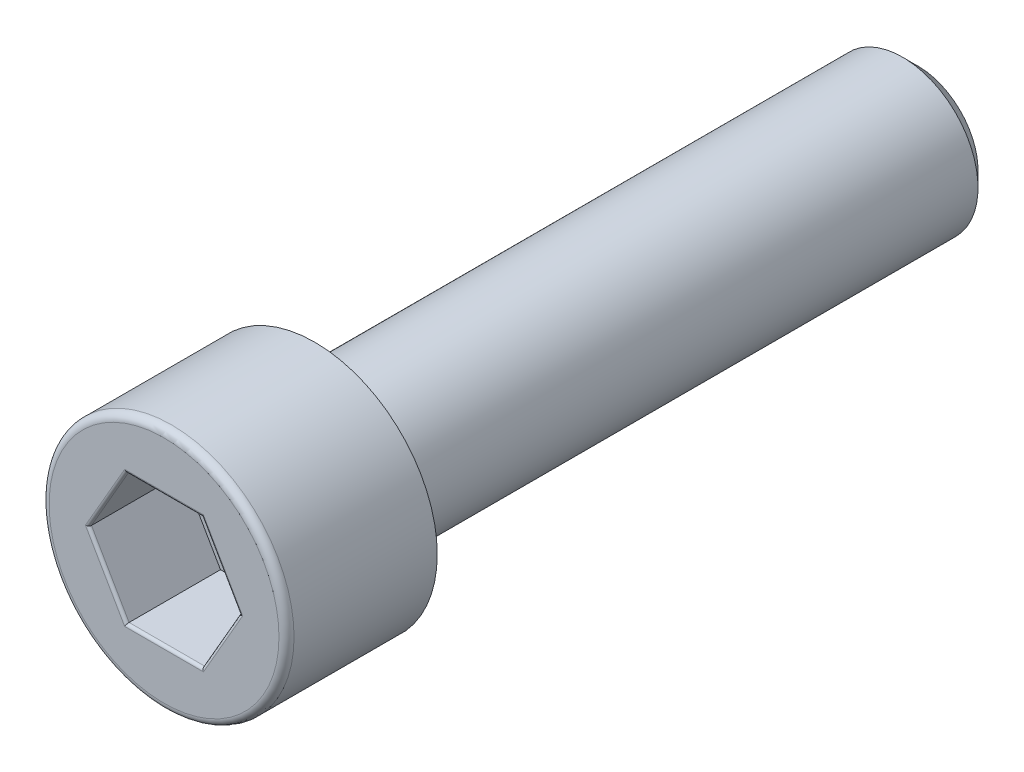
ISO-10303-21;
HEADER;
FILE_DESCRIPTION(('STEP AP214'),'2;1');
FILE_NAME('part.step','',(''),(''),'','','');
FILE_SCHEMA(('AUTOMOTIVE_DESIGN { 1 0 10303 214 1 1 1 1 }'));
ENDSEC;
DATA;
#1=APPLICATION_CONTEXT('core data for automotive mechanical design processes');
#2=APPLICATION_PROTOCOL_DEFINITION('international standard','automotive_design',2000,#1);
#3=PRODUCT_CONTEXT('',#1,'mechanical');
#4=PRODUCT('Part','Part','',(#3));
#5=PRODUCT_RELATED_PRODUCT_CATEGORY('part','',(#4));
#6=PRODUCT_DEFINITION_FORMATION('','',#4);
#7=PRODUCT_DEFINITION_CONTEXT('part definition',#1,'design');
#8=PRODUCT_DEFINITION('design','',#6,#7);
#9=PRODUCT_DEFINITION_SHAPE('','',#8);
#10=(LENGTH_UNIT() NAMED_UNIT(*) SI_UNIT(.MILLI.,.METRE.));
#11=(NAMED_UNIT(*) PLANE_ANGLE_UNIT() SI_UNIT($,.RADIAN.));
#12=(NAMED_UNIT(*) SI_UNIT($,.STERADIAN.) SOLID_ANGLE_UNIT());
#13=UNCERTAINTY_MEASURE_WITH_UNIT(LENGTH_MEASURE(1.E-05),#10,'distance_accuracy_value','');
#14=(GEOMETRIC_REPRESENTATION_CONTEXT(3) GLOBAL_UNCERTAINTY_ASSIGNED_CONTEXT((#13)) GLOBAL_UNIT_ASSIGNED_CONTEXT((#10,
#11,#12)) REPRESENTATION_CONTEXT('',''));
#15=CARTESIAN_POINT('',(0.,0.,0.));
#16=DIRECTION('',(0.,0.,1.));
#17=DIRECTION('',(1.,0.,0.));
#18=AXIS2_PLACEMENT_3D('',#15,#16,#17);
#19=CARTESIAN_POINT('',(0.,0.,0.));
#20=DIRECTION('',(0.,0.,1.));
#21=DIRECTION('',(1.,0.,0.));
#22=AXIS2_PLACEMENT_3D('',#19,#20,#21);
#23=PLANE('',#22);
#24=CARTESIAN_POINT('',(0.,0.,0.));
#25=DIRECTION('',(0.,0.,1.));
#26=DIRECTION('',(1.,0.,0.));
#27=AXIS2_PLACEMENT_3D('',#24,#25,#26);
#28=CIRCLE('',#27,6.5);
#29=CARTESIAN_POINT('',(6.5,0.,0.));
#30=VERTEX_POINT('',#29);
#31=EDGE_CURVE('E116',#30,#30,#28,.T.);
#32=ORIENTED_EDGE('',*,*,#31,.F.);
#33=EDGE_LOOP('',(#32));
#34=FACE_BOUND('',#33,.T.);
#35=CARTESIAN_POINT('',(0.,0.,0.));
#36=DIRECTION('',(0.,0.,-1.));
#37=DIRECTION('',(-1.,0.,0.));
#38=AXIS2_PLACEMENT_3D('',#35,#36,#37);
#39=CIRCLE('',#38,4.);
#40=CARTESIAN_POINT('',(-4.,0.,0.));
#41=VERTEX_POINT('',#40);
#42=EDGE_CURVE('E184',#41,#41,#39,.T.);
#43=ORIENTED_EDGE('',*,*,#42,.F.);
#44=EDGE_LOOP('',(#43));
#45=FACE_BOUND('',#44,.T.);
#46=ADVANCED_FACE('F34',(#34,#45),#23,.F.);
#47=CARTESIAN_POINT('',(0.,0.,8.));
#48=DIRECTION('',(0.,0.,1.));
#49=DIRECTION('',(1.,0.,0.));
#50=AXIS2_PLACEMENT_3D('',#47,#48,#49);
#51=PLANE('',#50);
#52=DIRECTION('',(0.499481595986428,-0.866324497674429,0.));
#53=VECTOR('',#52,1.);
#54=CARTESIAN_POINT('',(3.13202121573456,1.80577481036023,8.));
#55=LINE('',#54,#53);
#56=CARTESIAN_POINT('',(2.09080748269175,3.61170514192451,8.));
#57=VERTEX_POINT('',#56);
#58=CARTESIAN_POINT('',(4.173145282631,0.,8.));
#59=VERTEX_POINT('',#58);
#60=EDGE_CURVE('E162',#57,#59,#55,.T.);
#61=ORIENTED_EDGE('',*,*,#60,.T.);
#62=DIRECTION('',(-0.499481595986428,-0.866324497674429,0.));
#63=VECTOR('',#62,1.);
#64=CARTESIAN_POINT('',(3.13202121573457,-1.80577481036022,8.));
#65=LINE('',#64,#63);
#66=CARTESIAN_POINT('',(2.09080748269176,-3.61170514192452,8.));
#67=VERTEX_POINT('',#66);
#68=EDGE_CURVE('E172',#59,#67,#65,.T.);
#69=ORIENTED_EDGE('',*,*,#68,.T.);
#70=DIRECTION('',(-1.,0.,0.));
#71=VECTOR('',#70,1.);
#72=CARTESIAN_POINT('',(0.,-3.61170514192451,8.));
#73=LINE('',#72,#71);
#74=CARTESIAN_POINT('',(-2.09080748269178,-3.61170514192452,8.));
#75=VERTEX_POINT('',#74);
#76=EDGE_CURVE('E170',#67,#75,#73,.T.);
#77=ORIENTED_EDGE('',*,*,#76,.T.);
#78=DIRECTION('',(-0.499481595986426,0.86632449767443,0.));
#79=VECTOR('',#78,1.);
#80=CARTESIAN_POINT('',(-3.13202121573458,-1.80577481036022,8.));
#81=LINE('',#80,#79);
#82=CARTESIAN_POINT('',(-4.173145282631,0.,8.));
#83=VERTEX_POINT('',#82);
#84=EDGE_CURVE('E168',#75,#83,#81,.T.);
#85=ORIENTED_EDGE('',*,*,#84,.T.);
#86=DIRECTION('',(0.499481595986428,0.866324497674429,0.));
#87=VECTOR('',#86,1.);
#88=CARTESIAN_POINT('',(-3.13202121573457,1.80577481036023,8.));
#89=LINE('',#88,#87);
#90=CARTESIAN_POINT('',(-2.09080748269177,3.61170514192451,8.));
#91=VERTEX_POINT('',#90);
#92=EDGE_CURVE('E166',#83,#91,#89,.T.);
#93=ORIENTED_EDGE('',*,*,#92,.T.);
#94=DIRECTION('',(1.,0.,0.));
#95=VECTOR('',#94,1.);
#96=CARTESIAN_POINT('',(0.,3.61170514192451,8.));
#97=LINE('',#96,#95);
#98=EDGE_CURVE('E164',#91,#57,#97,.T.);
#99=ORIENTED_EDGE('',*,*,#98,.T.);
#100=EDGE_LOOP('',(#61,#69,#77,#85,#93,#99));
#101=FACE_BOUND('',#100,.T.);
#102=CARTESIAN_POINT('',(0.,0.,8.));
#103=DIRECTION('',(0.,0.,1.));
#104=DIRECTION('',(1.,0.,0.));
#105=AXIS2_PLACEMENT_3D('',#102,#103,#104);
#106=CIRCLE('',#105,6.1);
#107=CARTESIAN_POINT('',(6.1,0.,8.));
#108=VERTEX_POINT('',#107);
#109=EDGE_CURVE('E156',#108,#108,#106,.T.);
#110=ORIENTED_EDGE('',*,*,#109,.T.);
#111=EDGE_LOOP('',(#110));
#112=FACE_BOUND('',#111,.T.);
#113=ADVANCED_FACE('F237',(#101,#112),#51,.T.);
#114=CARTESIAN_POINT('',(0.,0.,8.));
#115=DIRECTION('',(0.,0.,-1.));
#116=DIRECTION('',(-1.,0.,0.));
#117=AXIS2_PLACEMENT_3D('',#114,#115,#116);
#118=CYLINDRICAL_SURFACE('',#117,6.5);
#119=CARTESIAN_POINT('',(0.,0.,7.6));
#120=DIRECTION('',(0.,0.,1.));
#121=DIRECTION('',(1.,0.,0.));
#122=AXIS2_PLACEMENT_3D('',#119,#120,#121);
#123=CIRCLE('',#122,6.5);
#124=CARTESIAN_POINT('',(6.5,0.,7.6));
#125=VERTEX_POINT('',#124);
#126=EDGE_CURVE('E159',#125,#125,#123,.F.);
#127=ORIENTED_EDGE('',*,*,#126,.T.);
#128=EDGE_LOOP('',(#127));
#129=FACE_BOUND('',#128,.T.);
#130=ORIENTED_EDGE('',*,*,#31,.T.);
#131=EDGE_LOOP('',(#130));
#132=FACE_BOUND('',#131,.T.);
#133=ADVANCED_FACE('F36',(#129,#132),#118,.T.);
#134=CARTESIAN_POINT('',(-2.00414508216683,-3.46170514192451,3.));
#135=DIRECTION('',(0.86632449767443,0.499481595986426,0.));
#136=DIRECTION('',(-0.499481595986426,0.86632449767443,0.));
#137=AXIS2_PLACEMENT_3D('',#134,#135,#136);
#138=PLANE('',#137);
#139=DIRECTION('',(0.,0.,1.));
#140=VECTOR('',#139,1.);
#141=CARTESIAN_POINT('',(-4.,0.,3.));
#142=LINE('',#141,#140);
#143=CARTESIAN_POINT('',(-4.,0.,3.));
#144=VERTEX_POINT('',#143);
#145=CARTESIAN_POINT('',(-4.,0.,7.85));
#146=VERTEX_POINT('',#145);
#147=EDGE_CURVE('E106',#144,#146,#142,.T.);
#148=ORIENTED_EDGE('',*,*,#147,.T.);
#149=DIRECTION('',(-0.499481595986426,0.86632449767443,0.));
#150=VECTOR('',#149,1.);
#151=CARTESIAN_POINT('',(-2.00414508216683,-3.46170514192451,7.85));
#152=LINE('',#151,#150);
#153=CARTESIAN_POINT('',(-2.00414508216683,-3.46170514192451,7.85));
#154=VERTEX_POINT('',#153);
#155=EDGE_CURVE('E180',#146,#154,#152,.F.);
#156=ORIENTED_EDGE('',*,*,#155,.T.);
#157=DIRECTION('',(0.,0.,1.));
#158=VECTOR('',#157,1.);
#159=CARTESIAN_POINT('',(-2.00414508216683,-3.46170514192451,3.));
#160=LINE('',#159,#158);
#161=CARTESIAN_POINT('',(-2.00414508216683,-3.46170514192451,3.));
#162=VERTEX_POINT('',#161);
#163=EDGE_CURVE('E123',#162,#154,#160,.T.);
#164=ORIENTED_EDGE('',*,*,#163,.F.);
#165=DIRECTION('',(-0.499481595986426,0.86632449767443,0.));
#166=VECTOR('',#165,1.);
#167=CARTESIAN_POINT('',(-2.00414508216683,-3.46170514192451,3.));
#168=LINE('',#167,#166);
#169=EDGE_CURVE('E120',#162,#144,#168,.T.);
#170=ORIENTED_EDGE('',*,*,#169,.T.);
#171=EDGE_LOOP('',(#148,#156,#164,#170));
#172=FACE_BOUND('',#171,.T.);
#173=ADVANCED_FACE('F121',(#172),#138,.T.);
#174=CARTESIAN_POINT('',(-4.,0.,3.));
#175=DIRECTION('',(0.866324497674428,-0.499481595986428,0.));
#176=DIRECTION('',(0.499481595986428,0.866324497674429,0.));
#177=AXIS2_PLACEMENT_3D('',#174,#175,#176);
#178=PLANE('',#177);
#179=DIRECTION('',(0.,0.,1.));
#180=VECTOR('',#179,1.);
#181=CARTESIAN_POINT('',(-2.0041450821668,3.46170514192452,3.));
#182=LINE('',#181,#180);
#183=CARTESIAN_POINT('',(-2.0041450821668,3.46170514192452,3.));
#184=VERTEX_POINT('',#183);
#185=CARTESIAN_POINT('',(-2.0041450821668,3.46170514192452,7.85));
#186=VERTEX_POINT('',#185);
#187=EDGE_CURVE('E117',#184,#186,#182,.T.);
#188=ORIENTED_EDGE('',*,*,#187,.T.);
#189=DIRECTION('',(0.499481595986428,0.866324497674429,0.));
#190=VECTOR('',#189,1.);
#191=CARTESIAN_POINT('',(-4.,0.,7.85));
#192=LINE('',#191,#190);
#193=EDGE_CURVE('E113',#186,#146,#192,.F.);
#194=ORIENTED_EDGE('',*,*,#193,.T.);
#195=ORIENTED_EDGE('',*,*,#147,.F.);
#196=DIRECTION('',(0.499481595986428,0.866324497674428,0.));
#197=VECTOR('',#196,1.);
#198=CARTESIAN_POINT('',(-4.,0.,3.));
#199=LINE('',#198,#197);
#200=EDGE_CURVE('E110',#144,#184,#199,.T.);
#201=ORIENTED_EDGE('',*,*,#200,.T.);
#202=EDGE_LOOP('',(#188,#194,#195,#201));
#203=FACE_BOUND('',#202,.T.);
#204=ADVANCED_FACE('F108',(#203),#178,.T.);
#205=CARTESIAN_POINT('',(-2.0041450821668,3.46170514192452,3.));
#206=DIRECTION('',(0.,-1.,0.));
#207=DIRECTION('',(0.,0.,-1.));
#208=AXIS2_PLACEMENT_3D('',#205,#206,#207);
#209=PLANE('',#208);
#210=DIRECTION('',(0.,0.,1.));
#211=VECTOR('',#210,1.);
#212=CARTESIAN_POINT('',(2.00414508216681,3.46170514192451,3.));
#213=LINE('',#212,#211);
#214=CARTESIAN_POINT('',(2.00414508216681,3.46170514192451,3.));
#215=VERTEX_POINT('',#214);
#216=CARTESIAN_POINT('',(2.00414508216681,3.46170514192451,7.85));
#217=VERTEX_POINT('',#216);
#218=EDGE_CURVE('E151',#215,#217,#213,.T.);
#219=ORIENTED_EDGE('',*,*,#218,.T.);
#220=DIRECTION('',(1.,0.,0.));
#221=VECTOR('',#220,1.);
#222=CARTESIAN_POINT('',(-2.0041450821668,3.46170514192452,7.85));
#223=LINE('',#222,#221);
#224=EDGE_CURVE('E56',#217,#186,#223,.F.);
#225=ORIENTED_EDGE('',*,*,#224,.T.);
#226=ORIENTED_EDGE('',*,*,#187,.F.);
#227=DIRECTION('',(1.,0.,0.));
#228=VECTOR('',#227,1.);
#229=CARTESIAN_POINT('',(-2.0041450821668,3.46170514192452,3.));
#230=LINE('',#229,#228);
#231=EDGE_CURVE('E132',#184,#215,#230,.T.);
#232=ORIENTED_EDGE('',*,*,#231,.T.);
#233=EDGE_LOOP('',(#219,#225,#226,#232));
#234=FACE_BOUND('',#233,.T.);
#235=ADVANCED_FACE('F227',(#234),#209,.T.);
#236=CARTESIAN_POINT('',(2.00414508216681,3.46170514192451,3.));
#237=DIRECTION('',(-0.866324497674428,-0.499481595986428,0.));
#238=DIRECTION('',(0.499481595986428,-0.866324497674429,0.));
#239=AXIS2_PLACEMENT_3D('',#236,#237,#238);
#240=PLANE('',#239);
#241=DIRECTION('',(0.,0.,1.));
#242=VECTOR('',#241,1.);
#243=CARTESIAN_POINT('',(4.,0.,3.));
#244=LINE('',#243,#242);
#245=CARTESIAN_POINT('',(4.,0.,3.));
#246=VERTEX_POINT('',#245);
#247=CARTESIAN_POINT('',(4.,0.,7.85));
#248=VERTEX_POINT('',#247);
#249=EDGE_CURVE('E149',#246,#248,#244,.T.);
#250=ORIENTED_EDGE('',*,*,#249,.T.);
#251=DIRECTION('',(0.499481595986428,-0.866324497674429,0.));
#252=VECTOR('',#251,1.);
#253=CARTESIAN_POINT('',(2.00414508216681,3.46170514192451,7.85));
#254=LINE('',#253,#252);
#255=EDGE_CURVE('E49',#248,#217,#254,.F.);
#256=ORIENTED_EDGE('',*,*,#255,.T.);
#257=ORIENTED_EDGE('',*,*,#218,.F.);
#258=DIRECTION('',(0.499481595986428,-0.866324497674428,0.));
#259=VECTOR('',#258,1.);
#260=CARTESIAN_POINT('',(2.00414508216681,3.46170514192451,3.));
#261=LINE('',#260,#259);
#262=EDGE_CURVE('E134',#215,#246,#261,.T.);
#263=ORIENTED_EDGE('',*,*,#262,.T.);
#264=EDGE_LOOP('',(#250,#256,#257,#263));
#265=FACE_BOUND('',#264,.T.);
#266=ADVANCED_FACE('F226',(#265),#240,.T.);
#267=CARTESIAN_POINT('',(4.,0.,3.));
#268=DIRECTION('',(-0.866324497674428,0.499481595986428,0.));
#269=DIRECTION('',(-0.499481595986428,-0.866324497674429,0.));
#270=AXIS2_PLACEMENT_3D('',#267,#268,#269);
#271=PLANE('',#270);
#272=DIRECTION('',(0.,0.,1.));
#273=VECTOR('',#272,1.);
#274=CARTESIAN_POINT('',(2.0041450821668,-3.46170514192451,3.));
#275=LINE('',#274,#273);
#276=CARTESIAN_POINT('',(2.0041450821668,-3.46170514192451,3.));
#277=VERTEX_POINT('',#276);
#278=CARTESIAN_POINT('',(2.0041450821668,-3.46170514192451,7.85));
#279=VERTEX_POINT('',#278);
#280=EDGE_CURVE('E146',#277,#279,#275,.T.);
#281=ORIENTED_EDGE('',*,*,#280,.T.);
#282=DIRECTION('',(-0.499481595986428,-0.866324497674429,0.));
#283=VECTOR('',#282,1.);
#284=CARTESIAN_POINT('',(4.,0.,7.85));
#285=LINE('',#284,#283);
#286=EDGE_CURVE('E175',#279,#248,#285,.F.);
#287=ORIENTED_EDGE('',*,*,#286,.T.);
#288=ORIENTED_EDGE('',*,*,#249,.F.);
#289=DIRECTION('',(-0.499481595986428,-0.866324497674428,0.));
#290=VECTOR('',#289,1.);
#291=CARTESIAN_POINT('',(4.,0.,3.));
#292=LINE('',#291,#290);
#293=EDGE_CURVE('E140',#246,#277,#292,.T.);
#294=ORIENTED_EDGE('',*,*,#293,.T.);
#295=EDGE_LOOP('',(#281,#287,#288,#294));
#296=FACE_BOUND('',#295,.T.);
#297=ADVANCED_FACE('F224',(#296),#271,.T.);
#298=CARTESIAN_POINT('',(2.0041450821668,-3.46170514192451,3.));
#299=DIRECTION('',(0.,1.,0.));
#300=DIRECTION('',(-1.,0.,0.));
#301=AXIS2_PLACEMENT_3D('',#298,#299,#300);
#302=PLANE('',#301);
#303=ORIENTED_EDGE('',*,*,#163,.T.);
#304=DIRECTION('',(-1.,0.,0.));
#305=VECTOR('',#304,1.);
#306=CARTESIAN_POINT('',(2.0041450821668,-3.46170514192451,7.85));
#307=LINE('',#306,#305);
#308=EDGE_CURVE('E178',#154,#279,#307,.F.);
#309=ORIENTED_EDGE('',*,*,#308,.T.);
#310=ORIENTED_EDGE('',*,*,#280,.F.);
#311=DIRECTION('',(-1.,0.,0.));
#312=VECTOR('',#311,1.);
#313=CARTESIAN_POINT('',(2.0041450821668,-3.46170514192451,3.));
#314=LINE('',#313,#312);
#315=EDGE_CURVE('E143',#277,#162,#314,.T.);
#316=ORIENTED_EDGE('',*,*,#315,.T.);
#317=EDGE_LOOP('',(#303,#309,#310,#316));
#318=FACE_BOUND('',#317,.T.);
#319=ADVANCED_FACE('F221',(#318),#302,.T.);
#320=CARTESIAN_POINT('',(-5.99585491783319,3.46170514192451,3.));
#321=DIRECTION('',(0.,0.,-1.));
#322=DIRECTION('',(-1.,0.,0.));
#323=AXIS2_PLACEMENT_3D('',#320,#321,#322);
#324=PLANE('',#323);
#325=ORIENTED_EDGE('',*,*,#169,.F.);
#326=ORIENTED_EDGE('',*,*,#315,.F.);
#327=ORIENTED_EDGE('',*,*,#293,.F.);
#328=ORIENTED_EDGE('',*,*,#262,.F.);
#329=ORIENTED_EDGE('',*,*,#231,.F.);
#330=ORIENTED_EDGE('',*,*,#200,.F.);
#331=EDGE_LOOP('',(#325,#326,#327,#328,#329,#330));
#332=FACE_BOUND('',#331,.T.);
#333=ADVANCED_FACE('F129',(#332),#324,.F.);
#334=CARTESIAN_POINT('',(0.,0.,7.6));
#335=DIRECTION('',(0.,0.,1.));
#336=DIRECTION('',(1.,0.,0.));
#337=AXIS2_PLACEMENT_3D('',#334,#335,#336);
#338=TOROIDAL_SURFACE('',#337,6.1,0.4);
#339=ORIENTED_EDGE('',*,*,#126,.F.);
#340=EDGE_LOOP('',(#339));
#341=FACE_BOUND('',#340,.T.);
#342=ORIENTED_EDGE('',*,*,#109,.F.);
#343=EDGE_LOOP('',(#342));
#344=FACE_BOUND('',#343,.T.);
#345=ADVANCED_FACE('F255',(#341,#344),#338,.T.);
#346=CARTESIAN_POINT('',(-3.13202121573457,1.80577481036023,7.85));
#347=DIRECTION('',(0.499481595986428,0.866324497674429,0.));
#348=DIRECTION('',(-0.866324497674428,0.499481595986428,0.));
#349=AXIS2_PLACEMENT_3D('',#346,#347,#348);
#350=CYLINDRICAL_SURFACE('',#349,0.15);
#351=CARTESIAN_POINT('',(-4.173145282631,0.,7.85));
#352=DIRECTION('',(0.,1.,0.));
#353=DIRECTION('',(-1.,0.,0.));
#354=AXIS2_PLACEMENT_3D('',#351,#352,#353);
#355=ELLIPSE('',#354,0.173145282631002,0.15);
#356=EDGE_CURVE('E203',#146,#83,#355,.F.);
#357=ORIENTED_EDGE('',*,*,#356,.F.);
#358=ORIENTED_EDGE('',*,*,#193,.F.);
#359=CARTESIAN_POINT('',(-2.09080748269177,3.61170514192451,7.85));
#360=DIRECTION('',(0.865875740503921,0.500259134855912,0.));
#361=DIRECTION('',(-0.500259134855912,0.865875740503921,0.));
#362=AXIS2_PLACEMENT_3D('',#359,#360,#361);
#363=ELLIPSE('',#362,0.173235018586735,0.15);
#364=EDGE_CURVE('E127',#91,#186,#363,.T.);
#365=ORIENTED_EDGE('',*,*,#364,.F.);
#366=ORIENTED_EDGE('',*,*,#92,.F.);
#367=EDGE_LOOP('',(#357,#358,#365,#366));
#368=FACE_BOUND('',#367,.T.);
#369=ADVANCED_FACE('F213',(#368),#350,.T.);
#370=CARTESIAN_POINT('',(0.,3.61170514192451,7.85));
#371=DIRECTION('',(1.,0.,0.));
#372=DIRECTION('',(0.,0.,-1.));
#373=AXIS2_PLACEMENT_3D('',#370,#371,#372);
#374=CYLINDRICAL_SURFACE('',#373,0.15);
#375=ORIENTED_EDGE('',*,*,#364,.T.);
#376=ORIENTED_EDGE('',*,*,#224,.F.);
#377=CARTESIAN_POINT('',(2.09080748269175,3.61170514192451,7.85));
#378=DIRECTION('',(0.865875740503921,-0.500259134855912,0.));
#379=DIRECTION('',(0.500259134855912,0.865875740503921,0.));
#380=AXIS2_PLACEMENT_3D('',#377,#378,#379);
#381=ELLIPSE('',#380,0.173235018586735,0.15);
#382=EDGE_CURVE('E200',#57,#217,#381,.T.);
#383=ORIENTED_EDGE('',*,*,#382,.F.);
#384=ORIENTED_EDGE('',*,*,#98,.F.);
#385=EDGE_LOOP('',(#375,#376,#383,#384));
#386=FACE_BOUND('',#385,.T.);
#387=ADVANCED_FACE('F209',(#386),#374,.T.);
#388=CARTESIAN_POINT('',(-3.13202121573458,-1.80577481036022,7.85));
#389=DIRECTION('',(-0.499481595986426,0.86632449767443,0.));
#390=DIRECTION('',(-0.86632449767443,-0.499481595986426,0.));
#391=AXIS2_PLACEMENT_3D('',#388,#389,#390);
#392=CYLINDRICAL_SURFACE('',#391,0.15);
#393=ORIENTED_EDGE('',*,*,#356,.T.);
#394=ORIENTED_EDGE('',*,*,#84,.F.);
#395=CARTESIAN_POINT('',(-2.09080748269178,-3.61170514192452,7.85));
#396=DIRECTION('',(-0.86587574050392,0.500259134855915,0.));
#397=DIRECTION('',(-0.500259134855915,-0.86587574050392,0.));
#398=AXIS2_PLACEMENT_3D('',#395,#396,#397);
#399=ELLIPSE('',#398,0.173235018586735,0.15);
#400=EDGE_CURVE('E197',#154,#75,#399,.F.);
#401=ORIENTED_EDGE('',*,*,#400,.F.);
#402=ORIENTED_EDGE('',*,*,#155,.F.);
#403=EDGE_LOOP('',(#393,#394,#401,#402));
#404=FACE_BOUND('',#403,.T.);
#405=ADVANCED_FACE('F218',(#404),#392,.T.);
#406=CARTESIAN_POINT('',(3.13202121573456,1.80577481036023,7.85));
#407=DIRECTION('',(0.499481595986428,-0.866324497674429,0.));
#408=DIRECTION('',(0.866324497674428,0.499481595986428,0.));
#409=AXIS2_PLACEMENT_3D('',#406,#407,#408);
#410=CYLINDRICAL_SURFACE('',#409,0.15);
#411=ORIENTED_EDGE('',*,*,#382,.T.);
#412=ORIENTED_EDGE('',*,*,#255,.F.);
#413=CARTESIAN_POINT('',(4.173145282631,0.,7.85));
#414=DIRECTION('',(0.,-1.,0.));
#415=DIRECTION('',(-1.,0.,0.));
#416=AXIS2_PLACEMENT_3D('',#413,#414,#415);
#417=ELLIPSE('',#416,0.173145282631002,0.15);
#418=EDGE_CURVE('E195',#59,#248,#417,.T.);
#419=ORIENTED_EDGE('',*,*,#418,.F.);
#420=ORIENTED_EDGE('',*,*,#60,.F.);
#421=EDGE_LOOP('',(#411,#412,#419,#420));
#422=FACE_BOUND('',#421,.T.);
#423=ADVANCED_FACE('F358',(#422),#410,.T.);
#424=CARTESIAN_POINT('',(0.,-3.61170514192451,7.85));
#425=DIRECTION('',(-1.,0.,0.));
#426=DIRECTION('',(0.,-1.,0.));
#427=AXIS2_PLACEMENT_3D('',#424,#425,#426);
#428=CYLINDRICAL_SURFACE('',#427,0.15);
#429=ORIENTED_EDGE('',*,*,#400,.T.);
#430=ORIENTED_EDGE('',*,*,#76,.F.);
#431=CARTESIAN_POINT('',(2.09080748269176,-3.61170514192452,7.85));
#432=DIRECTION('',(-0.865875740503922,-0.500259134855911,0.));
#433=DIRECTION('',(0.500259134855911,-0.865875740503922,0.));
#434=AXIS2_PLACEMENT_3D('',#431,#432,#433);
#435=ELLIPSE('',#434,0.173235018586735,0.15);
#436=EDGE_CURVE('E193',#279,#67,#435,.F.);
#437=ORIENTED_EDGE('',*,*,#436,.F.);
#438=ORIENTED_EDGE('',*,*,#308,.F.);
#439=EDGE_LOOP('',(#429,#430,#437,#438));
#440=FACE_BOUND('',#439,.T.);
#441=ADVANCED_FACE('F351',(#440),#428,.T.);
#442=CARTESIAN_POINT('',(3.13202121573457,-1.80577481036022,7.85));
#443=DIRECTION('',(-0.499481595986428,-0.866324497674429,0.));
#444=DIRECTION('',(0.866324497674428,-0.499481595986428,0.));
#445=AXIS2_PLACEMENT_3D('',#442,#443,#444);
#446=CYLINDRICAL_SURFACE('',#445,0.15);
#447=ORIENTED_EDGE('',*,*,#418,.T.);
#448=ORIENTED_EDGE('',*,*,#286,.F.);
#449=ORIENTED_EDGE('',*,*,#436,.T.);
#450=ORIENTED_EDGE('',*,*,#68,.F.);
#451=EDGE_LOOP('',(#447,#448,#449,#450));
#452=FACE_BOUND('',#451,.T.);
#453=ADVANCED_FACE('F315',(#452),#446,.T.);
#454=CARTESIAN_POINT('',(0.,0.,-32.));
#455=DIRECTION('',(0.,0.,1.));
#456=DIRECTION('',(1.,0.,0.));
#457=AXIS2_PLACEMENT_3D('',#454,#455,#456);
#458=CYLINDRICAL_SURFACE('',#457,4.);
#459=CARTESIAN_POINT('',(0.,0.,-31.2));
#460=DIRECTION('',(0.,0.,-1.));
#461=DIRECTION('',(-1.,0.,0.));
#462=AXIS2_PLACEMENT_3D('',#459,#460,#461);
#463=CIRCLE('',#462,4.);
#464=CARTESIAN_POINT('',(-4.,0.,-31.2));
#465=VERTEX_POINT('',#464);
#466=EDGE_CURVE('E11',#465,#465,#463,.F.);
#467=ORIENTED_EDGE('',*,*,#466,.T.);
#468=EDGE_LOOP('',(#467));
#469=FACE_BOUND('',#468,.T.);
#470=ORIENTED_EDGE('',*,*,#42,.T.);
#471=EDGE_LOOP('',(#470));
#472=FACE_BOUND('',#471,.T.);
#473=ADVANCED_FACE('F320',(#469,#472),#458,.T.);
#474=CARTESIAN_POINT('',(0.,0.,-32.));
#475=DIRECTION('',(0.,0.,-1.));
#476=DIRECTION('',(-1.,0.,0.));
#477=AXIS2_PLACEMENT_3D('',#474,#475,#476);
#478=PLANE('',#477);
#479=CARTESIAN_POINT('',(0.,0.,-32.));
#480=DIRECTION('',(0.,0.,-1.));
#481=DIRECTION('',(-1.,0.,0.));
#482=AXIS2_PLACEMENT_3D('',#479,#480,#481);
#483=CIRCLE('',#482,3.19999999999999);
#484=CARTESIAN_POINT('',(-3.19999999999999,0.,-32.));
#485=VERTEX_POINT('',#484);
#486=EDGE_CURVE('E42',#485,#485,#483,.T.);
#487=ORIENTED_EDGE('',*,*,#486,.T.);
#488=EDGE_LOOP('',(#487));
#489=FACE_BOUND('',#488,.T.);
#490=ADVANCED_FACE('F326',(#489),#478,.T.);
#491=CARTESIAN_POINT('',(0.,0.,-32.));
#492=DIRECTION('',(0.,0.,1.));
#493=DIRECTION('',(1.,0.,0.));
#494=AXIS2_PLACEMENT_3D('',#491,#492,#493);
#495=CONICAL_SURFACE('',#494,3.19999999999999,0.785398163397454);
#496=ORIENTED_EDGE('',*,*,#466,.F.);
#497=EDGE_LOOP('',(#496));
#498=FACE_BOUND('',#497,.T.);
#499=ORIENTED_EDGE('',*,*,#486,.F.);
#500=EDGE_LOOP('',(#499));
#501=FACE_BOUND('',#500,.T.);
#502=ADVANCED_FACE('F329',(#498,#501),#495,.T.);
#503=CLOSED_SHELL('',(#46,#113,#133,#173,#204,#235,#266,#297,#319,#333,#345,#369,#387,#405,#423,
#441,#453,#473,#490,#502));
#504=MANIFOLD_SOLID_BREP('B2',#503);
#505=ADVANCED_BREP_SHAPE_REPRESENTATION('',(#18,#504),#14);
#506=SHAPE_DEFINITION_REPRESENTATION(#9,#505);
ENDSEC;
END-ISO-10303-21;
